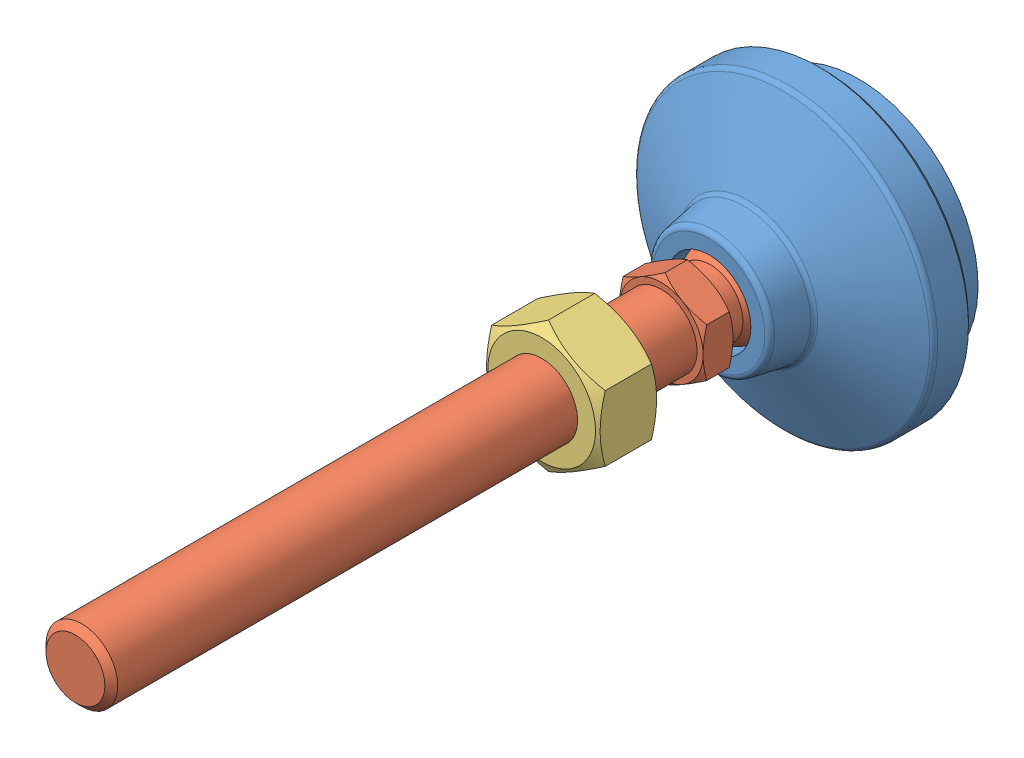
SolidWorks assembly LSVA50-M12X98.sldasm, configuration Default (file format 15000). Lengths in mm.
Overall size (50 50 131).
3 component instances, 3 part files, 0 mates.
Components (placement in the parent):
- LSVA50-M12X98_01-1: LSVA50-M12X98_01.SLDPRT [ﾃﾞﾌｫﾙﾄ] at (0 0 6) x (1 0 0) z (0 -1 0) size (50 25 50)
- LSVA50-M12X98_02-1: LSVA50-M12X98_02.SLDPRT [ﾃﾞﾌｫﾙﾄ] at (0 0 13.5) x (1 0 0) z (0 -1 0) size (14 117.5 16.17)
- LSVA50-M12X98_03-1: LSVA50-M12X98_03.SLDPRT [ﾃﾞﾌｫﾙﾄ] at (0 0 43) size (19 21.94 10)
